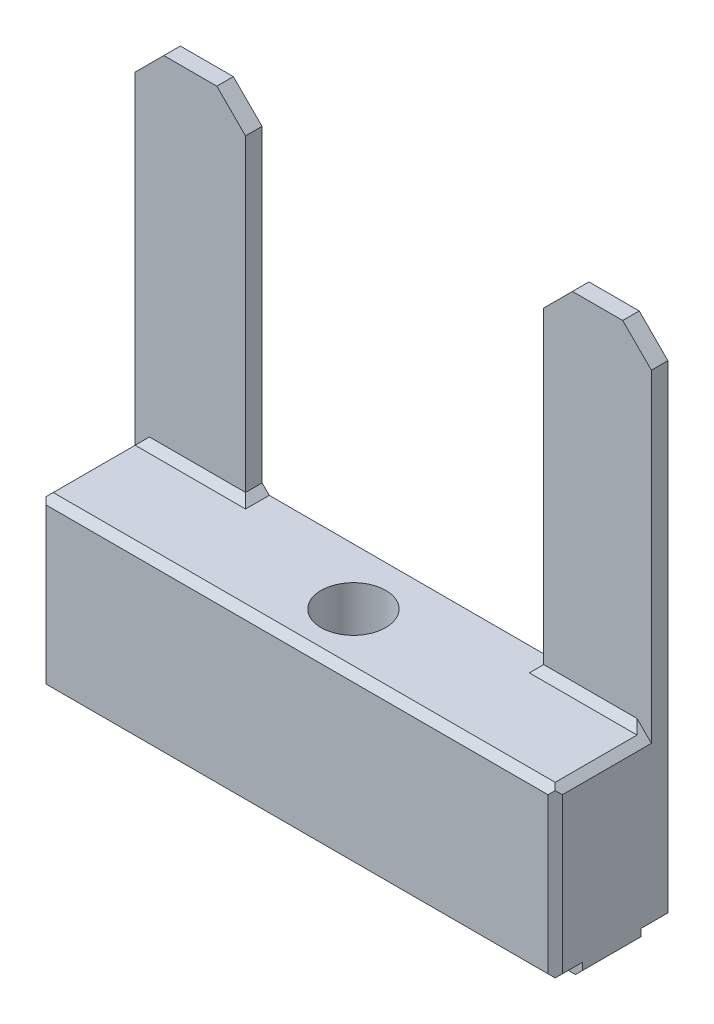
ISO-10303-21;
HEADER;
FILE_DESCRIPTION(('STEP AP214'),'2;1');
FILE_NAME('part.step','',(''),(''),'','','');
FILE_SCHEMA(('AUTOMOTIVE_DESIGN { 1 0 10303 214 1 1 1 1 }'));
ENDSEC;
DATA;
#1=APPLICATION_CONTEXT('core data for automotive mechanical design processes');
#2=APPLICATION_PROTOCOL_DEFINITION('international standard','automotive_design',2000,#1);
#3=PRODUCT_CONTEXT('',#1,'mechanical');
#4=PRODUCT('Part','Part','',(#3));
#5=PRODUCT_RELATED_PRODUCT_CATEGORY('part','',(#4));
#6=PRODUCT_DEFINITION_FORMATION('','',#4);
#7=PRODUCT_DEFINITION_CONTEXT('part definition',#1,'design');
#8=PRODUCT_DEFINITION('design','',#6,#7);
#9=PRODUCT_DEFINITION_SHAPE('','',#8);
#10=(LENGTH_UNIT() NAMED_UNIT(*) SI_UNIT(.MILLI.,.METRE.));
#11=(NAMED_UNIT(*) PLANE_ANGLE_UNIT() SI_UNIT($,.RADIAN.));
#12=(NAMED_UNIT(*) SI_UNIT($,.STERADIAN.) SOLID_ANGLE_UNIT());
#13=UNCERTAINTY_MEASURE_WITH_UNIT(LENGTH_MEASURE(1.E-05),#10,'distance_accuracy_value','');
#14=(GEOMETRIC_REPRESENTATION_CONTEXT(3) GLOBAL_UNCERTAINTY_ASSIGNED_CONTEXT((#13)) GLOBAL_UNIT_ASSIGNED_CONTEXT((#10,
#11,#12)) REPRESENTATION_CONTEXT('',''));
#15=CARTESIAN_POINT('',(0.,0.,0.));
#16=DIRECTION('',(0.,0.,1.));
#17=DIRECTION('',(1.,0.,0.));
#18=AXIS2_PLACEMENT_3D('',#15,#16,#17);
#19=CARTESIAN_POINT('',(0.,0.,2.921));
#20=DIRECTION('',(0.,0.,1.));
#21=DIRECTION('',(1.,0.,0.));
#22=AXIS2_PLACEMENT_3D('',#19,#20,#21);
#23=PLANE('',#22);
#24=DIRECTION('',(1.,0.,0.));
#25=VECTOR('',#24,1.);
#26=CARTESIAN_POINT('',(0.,90.932,2.921));
#27=LINE('',#26,#25);
#28=CARTESIAN_POINT('',(5.08000000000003,90.932,2.921));
#29=VERTEX_POINT('',#28);
#30=CARTESIAN_POINT('',(14.4526,90.932,2.921));
#31=VERTEX_POINT('',#30);
#32=EDGE_CURVE('E418',#29,#31,#27,.T.);
#33=ORIENTED_EDGE('',*,*,#32,.F.);
#34=DIRECTION('',(0.70710678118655,0.707106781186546,0.));
#35=VECTOR('',#34,1.);
#36=CARTESIAN_POINT('',(-42.926,42.9260000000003,2.921));
#37=LINE('',#36,#35);
#38=CARTESIAN_POINT('',(0.,85.852,2.921));
#39=VERTEX_POINT('',#38);
#40=EDGE_CURVE('E402',#29,#39,#37,.F.);
#41=ORIENTED_EDGE('',*,*,#40,.T.);
#42=DIRECTION('',(0.,1.,0.));
#43=VECTOR('',#42,1.);
#44=CARTESIAN_POINT('',(0.,0.,2.921));
#45=LINE('',#44,#43);
#46=CARTESIAN_POINT('',(0.,28.702,2.921));
#47=VERTEX_POINT('',#46);
#48=EDGE_CURVE('E422',#47,#39,#45,.T.);
#49=ORIENTED_EDGE('',*,*,#48,.F.);
#50=DIRECTION('',(-0.707106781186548,-0.707106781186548,0.));
#51=VECTOR('',#50,1.);
#52=CARTESIAN_POINT('',(0.,28.702,2.921));
#53=LINE('',#52,#51);
#54=CARTESIAN_POINT('',(2.54000000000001,31.242,2.921));
#55=VERTEX_POINT('',#54);
#56=EDGE_CURVE('E487',#47,#55,#53,.F.);
#57=ORIENTED_EDGE('',*,*,#56,.T.);
#58=DIRECTION('',(1.,0.,0.));
#59=VECTOR('',#58,1.);
#60=CARTESIAN_POINT('',(19.5326,31.242,2.921));
#61=LINE('',#60,#59);
#62=CARTESIAN_POINT('',(19.5326,31.242,2.921));
#63=VERTEX_POINT('',#62);
#64=EDGE_CURVE('E343',#55,#63,#61,.T.);
#65=ORIENTED_EDGE('',*,*,#64,.T.);
#66=DIRECTION('',(0.,1.,0.));
#67=VECTOR('',#66,1.);
#68=CARTESIAN_POINT('',(19.5326,29.972,2.921));
#69=LINE('',#68,#67);
#70=CARTESIAN_POINT('',(19.5326,85.852,2.921));
#71=VERTEX_POINT('',#70);
#72=EDGE_CURVE('E468',#63,#71,#69,.T.);
#73=ORIENTED_EDGE('',*,*,#72,.T.);
#74=DIRECTION('',(0.70710678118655,-0.707106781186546,0.));
#75=VECTOR('',#74,1.);
#76=CARTESIAN_POINT('',(52.6923,52.6923000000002,2.921));
#77=LINE('',#76,#75);
#78=EDGE_CURVE('E400',#71,#31,#77,.F.);
#79=ORIENTED_EDGE('',*,*,#78,.T.);
#80=EDGE_LOOP('',(#33,#41,#49,#57,#65,#73,#79));
#81=FACE_BOUND('',#80,.T.);
#82=ADVANCED_FACE('F35',(#81),#23,.T.);
#83=CARTESIAN_POINT('',(0.,90.932,2.921));
#84=DIRECTION('',(0.,1.,0.));
#85=DIRECTION('',(0.,0.,1.));
#86=AXIS2_PLACEMENT_3D('',#83,#84,#85);
#87=PLANE('',#86);
#88=DIRECTION('',(1.,0.,0.));
#89=VECTOR('',#88,1.);
#90=CARTESIAN_POINT('',(0.,90.932,0.));
#91=LINE('',#90,#89);
#92=CARTESIAN_POINT('',(5.08000000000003,90.932,0.));
#93=VERTEX_POINT('',#92);
#94=CARTESIAN_POINT('',(14.4526,90.932,0.));
#95=VERTEX_POINT('',#94);
#96=EDGE_CURVE('E432',#93,#95,#91,.T.);
#97=ORIENTED_EDGE('',*,*,#96,.F.);
#98=DIRECTION('',(0.,0.,1.));
#99=VECTOR('',#98,1.);
#100=CARTESIAN_POINT('',(5.08000000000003,90.932,2.921));
#101=LINE('',#100,#99);
#102=EDGE_CURVE('E398',#93,#29,#101,.T.);
#103=ORIENTED_EDGE('',*,*,#102,.T.);
#104=ORIENTED_EDGE('',*,*,#32,.T.);
#105=DIRECTION('',(0.,0.,-1.));
#106=VECTOR('',#105,1.);
#107=CARTESIAN_POINT('',(14.4526,90.932,2.921));
#108=LINE('',#107,#106);
#109=EDGE_CURVE('E396',#31,#95,#108,.T.);
#110=ORIENTED_EDGE('',*,*,#109,.T.);
#111=EDGE_LOOP('',(#97,#103,#104,#110));
#112=FACE_BOUND('',#111,.T.);
#113=ADVANCED_FACE('F604',(#112),#87,.T.);
#114=CARTESIAN_POINT('',(0.,0.,0.));
#115=DIRECTION('',(0.,0.,1.));
#116=DIRECTION('',(1.,0.,0.));
#117=AXIS2_PLACEMENT_3D('',#114,#115,#116);
#118=PLANE('',#117);
#119=DIRECTION('',(0.,1.,0.));
#120=VECTOR('',#119,1.);
#121=CARTESIAN_POINT('',(0.,0.,0.));
#122=LINE('',#121,#120);
#123=CARTESIAN_POINT('',(0.,1.26999999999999,0.));
#124=VERTEX_POINT('',#123);
#125=CARTESIAN_POINT('',(0.,85.852,0.));
#126=VERTEX_POINT('',#125);
#127=EDGE_CURVE('E423',#124,#126,#122,.T.);
#128=ORIENTED_EDGE('',*,*,#127,.T.);
#129=DIRECTION('',(-0.70710678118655,-0.707106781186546,0.));
#130=VECTOR('',#129,1.);
#131=CARTESIAN_POINT('',(0.,85.852,0.));
#132=LINE('',#131,#130);
#133=EDGE_CURVE('E394',#126,#93,#132,.F.);
#134=ORIENTED_EDGE('',*,*,#133,.T.);
#135=ORIENTED_EDGE('',*,*,#96,.T.);
#136=DIRECTION('',(-0.70710678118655,0.707106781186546,0.));
#137=VECTOR('',#136,1.);
#138=CARTESIAN_POINT('',(19.5326,85.852,0.));
#139=LINE('',#138,#137);
#140=CARTESIAN_POINT('',(19.5326,85.852,0.));
#141=VERTEX_POINT('',#140);
#142=EDGE_CURVE('E392',#95,#141,#139,.F.);
#143=ORIENTED_EDGE('',*,*,#142,.T.);
#144=DIRECTION('',(0.,1.,0.));
#145=VECTOR('',#144,1.);
#146=CARTESIAN_POINT('',(19.5326,29.972,0.));
#147=LINE('',#146,#145);
#148=CARTESIAN_POINT('',(19.5326,31.242,0.));
#149=VERTEX_POINT('',#148);
#150=EDGE_CURVE('E524',#149,#141,#147,.T.);
#151=ORIENTED_EDGE('',*,*,#150,.F.);
#152=DIRECTION('',(-0.707106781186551,0.707106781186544,0.));
#153=VECTOR('',#152,1.);
#154=CARTESIAN_POINT('',(25.3872999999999,25.3873000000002,0.));
#155=LINE('',#154,#153);
#156=CARTESIAN_POINT('',(20.8026,29.972,0.));
#157=VERTEX_POINT('',#156);
#158=EDGE_CURVE('E370',#149,#157,#155,.F.);
#159=ORIENTED_EDGE('',*,*,#158,.T.);
#160=DIRECTION('',(-1.,0.,0.));
#161=VECTOR('',#160,1.);
#162=CARTESIAN_POINT('',(72.263,29.972,0.));
#163=LINE('',#162,#161);
#164=CARTESIAN_POINT('',(70.993,29.972,0.));
#165=VERTEX_POINT('',#164);
#166=EDGE_CURVE('E531',#165,#157,#163,.T.);
#167=ORIENTED_EDGE('',*,*,#166,.F.);
#168=DIRECTION('',(0.707106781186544,0.707106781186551,0.));
#169=VECTOR('',#168,1.);
#170=CARTESIAN_POINT('',(20.5105000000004,-20.5105000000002,0.));
#171=LINE('',#170,#169);
#172=CARTESIAN_POINT('',(72.263,31.242,0.));
#173=VERTEX_POINT('',#172);
#174=EDGE_CURVE('E375',#165,#173,#171,.T.);
#175=ORIENTED_EDGE('',*,*,#174,.T.);
#176=DIRECTION('',(0.,1.,0.));
#177=VECTOR('',#176,1.);
#178=CARTESIAN_POINT('',(72.263,29.972,0.));
#179=LINE('',#178,#177);
#180=CARTESIAN_POINT('',(72.263,85.852,0.));
#181=VERTEX_POINT('',#180);
#182=EDGE_CURVE('E520',#173,#181,#179,.T.);
#183=ORIENTED_EDGE('',*,*,#182,.T.);
#184=DIRECTION('',(0.707106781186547,0.707106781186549,0.));
#185=VECTOR('',#184,1.);
#186=CARTESIAN_POINT('',(77.343,90.932,0.));
#187=LINE('',#186,#185);
#188=CARTESIAN_POINT('',(77.343,90.932,0.));
#189=VERTEX_POINT('',#188);
#190=EDGE_CURVE('E390',#181,#189,#187,.T.);
#191=ORIENTED_EDGE('',*,*,#190,.T.);
#192=CARTESIAN_POINT('',(86.233,90.932,0.));
#193=VERTEX_POINT('',#192);
#194=EDGE_CURVE('E412',#189,#193,#91,.T.);
#195=ORIENTED_EDGE('',*,*,#194,.T.);
#196=DIRECTION('',(0.707106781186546,-0.70710678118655,0.));
#197=VECTOR('',#196,1.);
#198=CARTESIAN_POINT('',(86.233,90.932,0.));
#199=LINE('',#198,#197);
#200=CARTESIAN_POINT('',(91.313,85.852,0.));
#201=VERTEX_POINT('',#200);
#202=EDGE_CURVE('E380',#193,#201,#199,.T.);
#203=ORIENTED_EDGE('',*,*,#202,.T.);
#204=DIRECTION('',(0.,1.,0.));
#205=VECTOR('',#204,1.);
#206=CARTESIAN_POINT('',(91.313,0.,0.));
#207=LINE('',#206,#205);
#208=CARTESIAN_POINT('',(91.313,1.26999999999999,0.));
#209=VERTEX_POINT('',#208);
#210=EDGE_CURVE('E430',#209,#201,#207,.T.);
#211=ORIENTED_EDGE('',*,*,#210,.F.);
#212=DIRECTION('',(-1.,0.,0.));
#213=VECTOR('',#212,1.);
#214=CARTESIAN_POINT('',(0.,1.26999999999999,0.));
#215=LINE('',#214,#213);
#216=EDGE_CURVE('E275',#209,#124,#215,.T.);
#217=ORIENTED_EDGE('',*,*,#216,.T.);
#218=EDGE_LOOP('',(#128,#134,#135,#143,#151,#159,#167,#175,#183,#191,#195,#203,#211,#217));
#219=FACE_BOUND('',#218,.T.);
#220=ADVANCED_FACE('F499',(#219),#118,.F.);
#221=CARTESIAN_POINT('',(0.,0.,2.921));
#222=DIRECTION('',(0.,1.,0.));
#223=DIRECTION('',(0.,0.,1.));
#224=AXIS2_PLACEMENT_3D('',#221,#222,#223);
#225=PLANE('',#224);
#226=DIRECTION('',(1.,0.,0.));
#227=VECTOR('',#226,1.);
#228=CARTESIAN_POINT('',(0.,0.,4.7752));
#229=LINE('',#228,#227);
#230=CARTESIAN_POINT('',(1.26999999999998,0.,4.7752));
#231=VERTEX_POINT('',#230);
#232=CARTESIAN_POINT('',(90.043,0.,4.7752));
#233=VERTEX_POINT('',#232);
#234=EDGE_CURVE('E513',#231,#233,#229,.T.);
#235=ORIENTED_EDGE('',*,*,#234,.F.);
#236=DIRECTION('',(0.,0.,-1.));
#237=VECTOR('',#236,1.);
#238=CARTESIAN_POINT('',(1.26999999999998,0.,1.26999999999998));
#239=LINE('',#238,#237);
#240=CARTESIAN_POINT('',(1.26999999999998,0.,1.26999999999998));
#241=VERTEX_POINT('',#240);
#242=EDGE_CURVE('E306',#231,#241,#239,.T.);
#243=ORIENTED_EDGE('',*,*,#242,.T.);
#244=DIRECTION('',(1.,0.,0.));
#245=VECTOR('',#244,1.);
#246=CARTESIAN_POINT('',(0.,0.,1.26999999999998));
#247=LINE('',#246,#245);
#248=CARTESIAN_POINT('',(90.043,0.,1.26999999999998));
#249=VERTEX_POINT('',#248);
#250=EDGE_CURVE('E492',#241,#249,#247,.T.);
#251=ORIENTED_EDGE('',*,*,#250,.T.);
#252=DIRECTION('',(0.,0.,1.));
#253=VECTOR('',#252,1.);
#254=CARTESIAN_POINT('',(90.043,0.,2.921));
#255=LINE('',#254,#253);
#256=EDGE_CURVE('E292',#249,#233,#255,.T.);
#257=ORIENTED_EDGE('',*,*,#256,.T.);
#258=EDGE_LOOP('',(#235,#243,#251,#257));
#259=FACE_BOUND('',#258,.T.);
#260=ADVANCED_FACE('F515',(#259),#225,.F.);
#261=CARTESIAN_POINT('',(77.343,90.932,2.921));
#262=VERTEX_POINT('',#261);
#263=CARTESIAN_POINT('',(86.233,90.932,2.921));
#264=VERTEX_POINT('',#263);
#265=EDGE_CURVE('E411',#262,#264,#27,.T.);
#266=ORIENTED_EDGE('',*,*,#265,.F.);
#267=DIRECTION('',(-0.707106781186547,-0.707106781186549,0.));
#268=VECTOR('',#267,1.);
#269=CARTESIAN_POINT('',(-6.79449999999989,6.79449999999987,2.921));
#270=LINE('',#269,#268);
#271=CARTESIAN_POINT('',(72.263,85.852,2.921));
#272=VERTEX_POINT('',#271);
#273=EDGE_CURVE('E44',#262,#272,#270,.T.);
#274=ORIENTED_EDGE('',*,*,#273,.T.);
#275=DIRECTION('',(0.,1.,0.));
#276=VECTOR('',#275,1.);
#277=CARTESIAN_POINT('',(72.263,29.972,2.921));
#278=LINE('',#277,#276);
#279=CARTESIAN_POINT('',(72.263,31.242,2.921));
#280=VERTEX_POINT('',#279);
#281=EDGE_CURVE('E529',#280,#272,#278,.T.);
#282=ORIENTED_EDGE('',*,*,#281,.F.);
#283=DIRECTION('',(1.,0.,0.));
#284=VECTOR('',#283,1.);
#285=CARTESIAN_POINT('',(90.043,31.242,2.921));
#286=LINE('',#285,#284);
#287=CARTESIAN_POINT('',(88.773,31.242,2.921));
#288=VERTEX_POINT('',#287);
#289=EDGE_CURVE('E350',#280,#288,#286,.T.);
#290=ORIENTED_EDGE('',*,*,#289,.T.);
#291=DIRECTION('',(0.707106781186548,-0.707106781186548,0.));
#292=VECTOR('',#291,1.);
#293=CARTESIAN_POINT('',(90.043,29.972,2.921));
#294=LINE('',#293,#292);
#295=CARTESIAN_POINT('',(91.313,28.702,2.921));
#296=VERTEX_POINT('',#295);
#297=EDGE_CURVE('E489',#288,#296,#294,.T.);
#298=ORIENTED_EDGE('',*,*,#297,.T.);
#299=DIRECTION('',(0.,1.,0.));
#300=VECTOR('',#299,1.);
#301=CARTESIAN_POINT('',(91.313,0.,2.921));
#302=LINE('',#301,#300);
#303=CARTESIAN_POINT('',(91.313,85.852,2.921));
#304=VERTEX_POINT('',#303);
#305=EDGE_CURVE('E419',#296,#304,#302,.T.);
#306=ORIENTED_EDGE('',*,*,#305,.T.);
#307=DIRECTION('',(-0.707106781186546,0.70710678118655,0.));
#308=VECTOR('',#307,1.);
#309=CARTESIAN_POINT('',(88.5825000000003,88.5824999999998,2.921));
#310=LINE('',#309,#308);
#311=EDGE_CURVE('E384',#304,#264,#310,.T.);
#312=ORIENTED_EDGE('',*,*,#311,.T.);
#313=EDGE_LOOP('',(#266,#274,#282,#290,#298,#306,#312));
#314=FACE_BOUND('',#313,.T.);
#315=ADVANCED_FACE('F414',(#314),#23,.T.);
#316=DIRECTION('',(-1.,0.,0.));
#317=VECTOR('',#316,1.);
#318=CARTESIAN_POINT('',(0.,0.,18.669));
#319=LINE('',#318,#317);
#320=CARTESIAN_POINT('',(90.043,0.,18.669));
#321=VERTEX_POINT('',#320);
#322=CARTESIAN_POINT('',(1.26999999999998,0.,18.669));
#323=VERTEX_POINT('',#322);
#324=EDGE_CURVE('E457',#321,#323,#319,.T.);
#325=ORIENTED_EDGE('',*,*,#324,.T.);
#326=DIRECTION('',(0.,0.,-1.));
#327=VECTOR('',#326,1.);
#328=CARTESIAN_POINT('',(1.26999999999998,0.,15.0876));
#329=LINE('',#328,#327);
#330=CARTESIAN_POINT('',(1.26999999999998,0.,15.0876));
#331=VERTEX_POINT('',#330);
#332=EDGE_CURVE('E332',#323,#331,#329,.T.);
#333=ORIENTED_EDGE('',*,*,#332,.T.);
#334=DIRECTION('',(1.,0.,0.));
#335=VECTOR('',#334,1.);
#336=CARTESIAN_POINT('',(0.,0.,15.0876));
#337=LINE('',#336,#335);
#338=CARTESIAN_POINT('',(90.043,0.,15.0876));
#339=VERTEX_POINT('',#338);
#340=EDGE_CURVE('E519',#331,#339,#337,.T.);
#341=ORIENTED_EDGE('',*,*,#340,.T.);
#342=DIRECTION('',(0.,0.,1.));
#343=VECTOR('',#342,1.);
#344=CARTESIAN_POINT('',(90.043,0.,2.921));
#345=LINE('',#344,#343);
#346=EDGE_CURVE('E263',#339,#321,#345,.T.);
#347=ORIENTED_EDGE('',*,*,#346,.T.);
#348=EDGE_LOOP('',(#325,#333,#341,#347));
#349=FACE_BOUND('',#348,.T.);
#350=ADVANCED_FACE('F653',(#349),#225,.F.);
#351=CARTESIAN_POINT('',(91.313,0.,2.921));
#352=DIRECTION('',(-1.,0.,0.));
#353=DIRECTION('',(0.,0.,1.));
#354=AXIS2_PLACEMENT_3D('',#351,#352,#353);
#355=PLANE('',#354);
#356=ORIENTED_EDGE('',*,*,#210,.T.);
#357=DIRECTION('',(0.,0.,1.));
#358=VECTOR('',#357,1.);
#359=CARTESIAN_POINT('',(91.313,85.852,2.921));
#360=LINE('',#359,#358);
#361=EDGE_CURVE('E382',#201,#304,#360,.T.);
#362=ORIENTED_EDGE('',*,*,#361,.T.);
#363=ORIENTED_EDGE('',*,*,#305,.F.);
#364=DIRECTION('',(0.,0.,1.));
#365=VECTOR('',#364,1.);
#366=CARTESIAN_POINT('',(91.313,28.702,18.669));
#367=LINE('',#366,#365);
#368=CARTESIAN_POINT('',(91.313,28.702,18.669));
#369=VERTEX_POINT('',#368);
#370=EDGE_CURVE('E483',#296,#369,#367,.T.);
#371=ORIENTED_EDGE('',*,*,#370,.T.);
#372=DIRECTION('',(0.,-1.,0.));
#373=VECTOR('',#372,1.);
#374=CARTESIAN_POINT('',(91.313,0.,18.669));
#375=LINE('',#374,#373);
#376=CARTESIAN_POINT('',(91.313,1.26999999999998,18.669));
#377=VERTEX_POINT('',#376);
#378=EDGE_CURVE('E460',#369,#377,#375,.T.);
#379=ORIENTED_EDGE('',*,*,#378,.T.);
#380=DIRECTION('',(0.,0.,-1.));
#381=VECTOR('',#380,1.);
#382=CARTESIAN_POINT('',(91.313,1.26999999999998,2.921));
#383=LINE('',#382,#381);
#384=CARTESIAN_POINT('',(91.313,1.26999999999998,15.0876));
#385=VERTEX_POINT('',#384);
#386=EDGE_CURVE('E274',#377,#385,#383,.T.);
#387=ORIENTED_EDGE('',*,*,#386,.T.);
#388=DIRECTION('',(0.,1.,0.));
#389=VECTOR('',#388,1.);
#390=CARTESIAN_POINT('',(91.313,-1.27,15.0876));
#391=LINE('',#390,#389);
#392=CARTESIAN_POINT('',(91.313,0.,15.0876));
#393=VERTEX_POINT('',#392);
#394=EDGE_CURVE('E255',#385,#393,#391,.F.);
#395=ORIENTED_EDGE('',*,*,#394,.T.);
#396=DIRECTION('',(0.,0.,-1.));
#397=VECTOR('',#396,1.);
#398=CARTESIAN_POINT('',(91.313,0.,4.7752));
#399=LINE('',#398,#397);
#400=CARTESIAN_POINT('',(91.313,0.,4.7752));
#401=VERTEX_POINT('',#400);
#402=EDGE_CURVE('E271',#393,#401,#399,.T.);
#403=ORIENTED_EDGE('',*,*,#402,.T.);
#404=DIRECTION('',(0.,1.,0.));
#405=VECTOR('',#404,1.);
#406=CARTESIAN_POINT('',(91.313,-1.27,4.7752));
#407=LINE('',#406,#405);
#408=CARTESIAN_POINT('',(91.313,1.26999999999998,4.7752));
#409=VERTEX_POINT('',#408);
#410=EDGE_CURVE('E281',#401,#409,#407,.T.);
#411=ORIENTED_EDGE('',*,*,#410,.T.);
#412=DIRECTION('',(0.,0.,-1.));
#413=VECTOR('',#412,1.);
#414=CARTESIAN_POINT('',(91.313,1.26999999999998,2.921));
#415=LINE('',#414,#413);
#416=EDGE_CURVE('E283',#409,#209,#415,.T.);
#417=ORIENTED_EDGE('',*,*,#416,.T.);
#418=EDGE_LOOP('',(#356,#362,#363,#371,#379,#387,#395,#403,#411,#417));
#419=FACE_BOUND('',#418,.T.);
#420=ADVANCED_FACE('F269',(#419),#355,.F.);
#421=ORIENTED_EDGE('',*,*,#194,.F.);
#422=DIRECTION('',(0.,0.,1.));
#423=VECTOR('',#422,1.);
#424=CARTESIAN_POINT('',(77.343,90.932,2.921));
#425=LINE('',#424,#423);
#426=EDGE_CURVE('E407',#189,#262,#425,.T.);
#427=ORIENTED_EDGE('',*,*,#426,.T.);
#428=ORIENTED_EDGE('',*,*,#265,.T.);
#429=DIRECTION('',(0.,0.,-1.));
#430=VECTOR('',#429,1.);
#431=CARTESIAN_POINT('',(86.233,90.932,0.));
#432=LINE('',#431,#430);
#433=EDGE_CURVE('E377',#264,#193,#432,.T.);
#434=ORIENTED_EDGE('',*,*,#433,.T.);
#435=EDGE_LOOP('',(#421,#427,#428,#434));
#436=FACE_BOUND('',#435,.T.);
#437=ADVANCED_FACE('F410',(#436),#87,.T.);
#438=CARTESIAN_POINT('',(0.,0.,2.921));
#439=DIRECTION('',(-1.,0.,0.));
#440=DIRECTION('',(0.,0.,1.));
#441=AXIS2_PLACEMENT_3D('',#438,#439,#440);
#442=PLANE('',#441);
#443=ORIENTED_EDGE('',*,*,#48,.T.);
#444=DIRECTION('',(0.,0.,-1.));
#445=VECTOR('',#444,1.);
#446=CARTESIAN_POINT('',(0.,85.852,2.921));
#447=LINE('',#446,#445);
#448=EDGE_CURVE('E387',#39,#126,#447,.T.);
#449=ORIENTED_EDGE('',*,*,#448,.T.);
#450=ORIENTED_EDGE('',*,*,#127,.F.);
#451=DIRECTION('',(0.,0.,1.));
#452=VECTOR('',#451,1.);
#453=CARTESIAN_POINT('',(0.,1.26999999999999,4.7752));
#454=LINE('',#453,#452);
#455=CARTESIAN_POINT('',(0.,1.26999999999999,4.7752));
#456=VERTEX_POINT('',#455);
#457=EDGE_CURVE('E322',#124,#456,#454,.T.);
#458=ORIENTED_EDGE('',*,*,#457,.T.);
#459=DIRECTION('',(0.,1.,0.));
#460=VECTOR('',#459,1.);
#461=CARTESIAN_POINT('',(0.,-1.27,4.7752));
#462=LINE('',#461,#460);
#463=CARTESIAN_POINT('',(0.,0.,4.7752));
#464=VERTEX_POINT('',#463);
#465=EDGE_CURVE('E319',#456,#464,#462,.F.);
#466=ORIENTED_EDGE('',*,*,#465,.T.);
#467=DIRECTION('',(0.,0.,1.));
#468=VECTOR('',#467,1.);
#469=CARTESIAN_POINT('',(0.,0.,2.921));
#470=LINE('',#469,#468);
#471=CARTESIAN_POINT('',(0.,0.,15.0876));
#472=VERTEX_POINT('',#471);
#473=EDGE_CURVE('E316',#464,#472,#470,.T.);
#474=ORIENTED_EDGE('',*,*,#473,.T.);
#475=DIRECTION('',(0.,1.,0.));
#476=VECTOR('',#475,1.);
#477=CARTESIAN_POINT('',(0.,-1.27,15.0876));
#478=LINE('',#477,#476);
#479=CARTESIAN_POINT('',(0.,1.26999999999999,15.0876));
#480=VERTEX_POINT('',#479);
#481=EDGE_CURVE('E313',#472,#480,#478,.T.);
#482=ORIENTED_EDGE('',*,*,#481,.T.);
#483=DIRECTION('',(0.,0.,1.));
#484=VECTOR('',#483,1.);
#485=CARTESIAN_POINT('',(0.,1.26999999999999,18.669));
#486=LINE('',#485,#484);
#487=CARTESIAN_POINT('',(0.,1.26999999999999,18.669));
#488=VERTEX_POINT('',#487);
#489=EDGE_CURVE('E311',#480,#488,#486,.T.);
#490=ORIENTED_EDGE('',*,*,#489,.T.);
#491=DIRECTION('',(0.,1.,0.));
#492=VECTOR('',#491,1.);
#493=CARTESIAN_POINT('',(0.,28.702,18.669));
#494=LINE('',#493,#492);
#495=CARTESIAN_POINT('',(0.,28.702,18.669));
#496=VERTEX_POINT('',#495);
#497=EDGE_CURVE('E442',#488,#496,#494,.T.);
#498=ORIENTED_EDGE('',*,*,#497,.T.);
#499=DIRECTION('',(0.,0.,-1.));
#500=VECTOR('',#499,1.);
#501=CARTESIAN_POINT('',(0.,28.702,2.921));
#502=LINE('',#501,#500);
#503=EDGE_CURVE('E462',#496,#47,#502,.T.);
#504=ORIENTED_EDGE('',*,*,#503,.T.);
#505=EDGE_LOOP('',(#443,#449,#450,#458,#466,#474,#482,#490,#498,#504));
#506=FACE_BOUND('',#505,.T.);
#507=ADVANCED_FACE('F503',(#506),#442,.T.);
#508=CARTESIAN_POINT('',(0.,29.972,19.939));
#509=DIRECTION('',(0.,1.,0.));
#510=DIRECTION('',(0.,0.,1.));
#511=AXIS2_PLACEMENT_3D('',#508,#509,#510);
#512=PLANE('',#511);
#513=CARTESIAN_POINT('',(45.6565,29.972,9.9695));
#514=DIRECTION('',(0.,1.,0.));
#515=DIRECTION('',(0.,0.,1.));
#516=AXIS2_PLACEMENT_3D('',#513,#514,#515);
#517=CIRCLE('',#516,5.715);
#518=CARTESIAN_POINT('',(45.6565,29.972,15.6845));
#519=VERTEX_POINT('',#518);
#520=EDGE_CURVE('E538',#519,#519,#517,.T.);
#521=ORIENTED_EDGE('',*,*,#520,.F.);
#522=EDGE_LOOP('',(#521));
#523=FACE_BOUND('',#522,.T.);
#524=ORIENTED_EDGE('',*,*,#166,.T.);
#525=DIRECTION('',(0.,0.,1.));
#526=VECTOR('',#525,1.);
#527=CARTESIAN_POINT('',(20.8026,29.972,4.19099999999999));
#528=LINE('',#527,#526);
#529=CARTESIAN_POINT('',(20.8026,29.972,4.19099999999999));
#530=VERTEX_POINT('',#529);
#531=EDGE_CURVE('E360',#157,#530,#528,.T.);
#532=ORIENTED_EDGE('',*,*,#531,.T.);
#533=DIRECTION('',(-1.,0.,0.));
#534=VECTOR('',#533,1.);
#535=CARTESIAN_POINT('',(1.27000000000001,29.972,4.19099999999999));
#536=LINE('',#535,#534);
#537=CARTESIAN_POINT('',(1.27000000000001,29.972,4.19099999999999));
#538=VERTEX_POINT('',#537);
#539=EDGE_CURVE('E348',#530,#538,#536,.T.);
#540=ORIENTED_EDGE('',*,*,#539,.T.);
#541=DIRECTION('',(0.,0.,1.));
#542=VECTOR('',#541,1.);
#543=CARTESIAN_POINT('',(1.27000000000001,29.972,19.939));
#544=LINE('',#543,#542);
#545=CARTESIAN_POINT('',(1.27000000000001,29.972,18.669));
#546=VERTEX_POINT('',#545);
#547=EDGE_CURVE('E474',#538,#546,#544,.T.);
#548=ORIENTED_EDGE('',*,*,#547,.T.);
#549=DIRECTION('',(1.,0.,0.));
#550=VECTOR('',#549,1.);
#551=CARTESIAN_POINT('',(91.313,29.972,18.669));
#552=LINE('',#551,#550);
#553=CARTESIAN_POINT('',(90.043,29.972,18.669));
#554=VERTEX_POINT('',#553);
#555=EDGE_CURVE('E429',#546,#554,#552,.T.);
#556=ORIENTED_EDGE('',*,*,#555,.T.);
#557=DIRECTION('',(0.,0.,-1.));
#558=VECTOR('',#557,1.);
#559=CARTESIAN_POINT('',(90.043,29.972,2.921));
#560=LINE('',#559,#558);
#561=CARTESIAN_POINT('',(90.043,29.972,4.19099999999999));
#562=VERTEX_POINT('',#561);
#563=EDGE_CURVE('E471',#554,#562,#560,.T.);
#564=ORIENTED_EDGE('',*,*,#563,.T.);
#565=DIRECTION('',(-1.,0.,0.));
#566=VECTOR('',#565,1.);
#567=CARTESIAN_POINT('',(72.263,29.972,4.19099999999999));
#568=LINE('',#567,#566);
#569=CARTESIAN_POINT('',(70.993,29.972,4.19099999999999));
#570=VERTEX_POINT('',#569);
#571=EDGE_CURVE('E346',#562,#570,#568,.T.);
#572=ORIENTED_EDGE('',*,*,#571,.T.);
#573=DIRECTION('',(0.,0.,-1.));
#574=VECTOR('',#573,1.);
#575=CARTESIAN_POINT('',(70.993,29.972,19.939));
#576=LINE('',#575,#574);
#577=EDGE_CURVE('E358',#570,#165,#576,.T.);
#578=ORIENTED_EDGE('',*,*,#577,.T.);
#579=EDGE_LOOP('',(#524,#532,#540,#548,#556,#564,#572,#578));
#580=FACE_BOUND('',#579,.T.);
#581=ADVANCED_FACE('F571',(#523,#580),#512,.T.);
#582=CARTESIAN_POINT('',(0.,0.,19.939));
#583=DIRECTION('',(0.,0.,-1.));
#584=DIRECTION('',(-1.,0.,0.));
#585=AXIS2_PLACEMENT_3D('',#582,#583,#584);
#586=PLANE('',#585);
#587=DIRECTION('',(-1.,0.,0.));
#588=VECTOR('',#587,1.);
#589=CARTESIAN_POINT('',(0.,28.702,19.939));
#590=LINE('',#589,#588);
#591=CARTESIAN_POINT('',(90.043,28.702,19.939));
#592=VERTEX_POINT('',#591);
#593=CARTESIAN_POINT('',(1.27000000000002,28.702,19.939));
#594=VERTEX_POINT('',#593);
#595=EDGE_CURVE('E439',#592,#594,#590,.T.);
#596=ORIENTED_EDGE('',*,*,#595,.T.);
#597=DIRECTION('',(0.,-1.,0.));
#598=VECTOR('',#597,1.);
#599=CARTESIAN_POINT('',(1.27000000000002,0.,19.939));
#600=LINE('',#599,#598);
#601=CARTESIAN_POINT('',(1.27000000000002,1.27000000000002,19.939));
#602=VERTEX_POINT('',#601);
#603=EDGE_CURVE('E454',#594,#602,#600,.T.);
#604=ORIENTED_EDGE('',*,*,#603,.T.);
#605=DIRECTION('',(1.,0.,0.));
#606=VECTOR('',#605,1.);
#607=CARTESIAN_POINT('',(0.,1.27000000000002,19.939));
#608=LINE('',#607,#606);
#609=CARTESIAN_POINT('',(90.043,1.27000000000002,19.939));
#610=VERTEX_POINT('',#609);
#611=EDGE_CURVE('E451',#602,#610,#608,.T.);
#612=ORIENTED_EDGE('',*,*,#611,.T.);
#613=DIRECTION('',(0.,1.,0.));
#614=VECTOR('',#613,1.);
#615=CARTESIAN_POINT('',(90.043,0.,19.939));
#616=LINE('',#615,#614);
#617=EDGE_CURVE('E449',#610,#592,#616,.T.);
#618=ORIENTED_EDGE('',*,*,#617,.T.);
#619=EDGE_LOOP('',(#596,#604,#612,#618));
#620=FACE_BOUND('',#619,.T.);
#621=ADVANCED_FACE('F574',(#620),#586,.F.);
#622=CARTESIAN_POINT('',(0.,-1.27,4.7752));
#623=DIRECTION('',(0.,0.,1.));
#624=DIRECTION('',(1.,0.,0.));
#625=AXIS2_PLACEMENT_3D('',#622,#623,#624);
#626=PLANE('',#625);
#627=DIRECTION('',(1.,0.,0.));
#628=VECTOR('',#627,1.);
#629=CARTESIAN_POINT('',(0.,-1.27,4.7752));
#630=LINE('',#629,#628);
#631=CARTESIAN_POINT('',(1.26999999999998,-1.27,4.7752));
#632=VERTEX_POINT('',#631);
#633=CARTESIAN_POINT('',(90.043,-1.27,4.7752));
#634=VERTEX_POINT('',#633);
#635=EDGE_CURVE('E522',#632,#634,#630,.T.);
#636=ORIENTED_EDGE('',*,*,#635,.F.);
#637=DIRECTION('',(0.707106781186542,-0.707106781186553,0.));
#638=VECTOR('',#637,1.);
#639=CARTESIAN_POINT('',(1.26999999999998,-1.27,4.7752));
#640=LINE('',#639,#638);
#641=EDGE_CURVE('E328',#632,#464,#640,.F.);
#642=ORIENTED_EDGE('',*,*,#641,.T.);
#643=ORIENTED_EDGE('',*,*,#465,.F.);
#644=DIRECTION('',(0.707106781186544,-0.707106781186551,0.));
#645=VECTOR('',#644,1.);
#646=CARTESIAN_POINT('',(1.27,0.,4.7752));
#647=LINE('',#646,#645);
#648=EDGE_CURVE('E339',#456,#231,#647,.T.);
#649=ORIENTED_EDGE('',*,*,#648,.T.);
#650=ORIENTED_EDGE('',*,*,#234,.T.);
#651=DIRECTION('',(-0.707106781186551,-0.707106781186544,0.));
#652=VECTOR('',#651,1.);
#653=CARTESIAN_POINT('',(44.3864999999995,-45.6565,4.7752));
#654=LINE('',#653,#652);
#655=EDGE_CURVE('E302',#233,#409,#654,.F.);
#656=ORIENTED_EDGE('',*,*,#655,.T.);
#657=ORIENTED_EDGE('',*,*,#410,.F.);
#658=DIRECTION('',(-0.707106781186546,-0.707106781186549,0.));
#659=VECTOR('',#658,1.);
#660=CARTESIAN_POINT('',(91.313,0.,4.7752));
#661=LINE('',#660,#659);
#662=EDGE_CURVE('E279',#401,#634,#661,.T.);
#663=ORIENTED_EDGE('',*,*,#662,.T.);
#664=EDGE_LOOP('',(#636,#642,#643,#649,#650,#656,#657,#663));
#665=FACE_BOUND('',#664,.T.);
#666=ADVANCED_FACE('F512',(#665),#626,.F.);
#667=CARTESIAN_POINT('',(0.,-1.27,15.0876));
#668=DIRECTION('',(0.,0.,1.));
#669=DIRECTION('',(1.,0.,0.));
#670=AXIS2_PLACEMENT_3D('',#667,#668,#669);
#671=PLANE('',#670);
#672=ORIENTED_EDGE('',*,*,#340,.F.);
#673=DIRECTION('',(-0.707106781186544,0.707106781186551,0.));
#674=VECTOR('',#673,1.);
#675=CARTESIAN_POINT('',(1.26999999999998,0.,15.0876));
#676=LINE('',#675,#674);
#677=EDGE_CURVE('E341',#331,#480,#676,.T.);
#678=ORIENTED_EDGE('',*,*,#677,.T.);
#679=ORIENTED_EDGE('',*,*,#481,.F.);
#680=DIRECTION('',(-0.707106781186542,0.707106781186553,0.));
#681=VECTOR('',#680,1.);
#682=CARTESIAN_POINT('',(0.635,-0.63500000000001,15.0876));
#683=LINE('',#682,#681);
#684=CARTESIAN_POINT('',(1.26999999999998,-1.27,15.0876));
#685=VERTEX_POINT('',#684);
#686=EDGE_CURVE('E330',#472,#685,#683,.F.);
#687=ORIENTED_EDGE('',*,*,#686,.T.);
#688=DIRECTION('',(1.,0.,0.));
#689=VECTOR('',#688,1.);
#690=CARTESIAN_POINT('',(0.,-1.27,15.0876));
#691=LINE('',#690,#689);
#692=CARTESIAN_POINT('',(90.043,-1.27,15.0876));
#693=VERTEX_POINT('',#692);
#694=EDGE_CURVE('E258',#685,#693,#691,.T.);
#695=ORIENTED_EDGE('',*,*,#694,.T.);
#696=DIRECTION('',(0.707106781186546,0.707106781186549,0.));
#697=VECTOR('',#696,1.);
#698=CARTESIAN_POINT('',(45.0215000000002,-46.2915,15.0876));
#699=LINE('',#698,#697);
#700=EDGE_CURVE('E250',#693,#393,#699,.T.);
#701=ORIENTED_EDGE('',*,*,#700,.T.);
#702=ORIENTED_EDGE('',*,*,#394,.F.);
#703=DIRECTION('',(0.707106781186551,0.707106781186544,0.));
#704=VECTOR('',#703,1.);
#705=CARTESIAN_POINT('',(91.313,1.26999999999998,15.0876));
#706=LINE('',#705,#704);
#707=EDGE_CURVE('E304',#385,#339,#706,.F.);
#708=ORIENTED_EDGE('',*,*,#707,.T.);
#709=EDGE_LOOP('',(#672,#678,#679,#687,#695,#701,#702,#708));
#710=FACE_BOUND('',#709,.T.);
#711=ADVANCED_FACE('F253',(#710),#671,.T.);
#712=CARTESIAN_POINT('',(0.,-1.27,0.));
#713=DIRECTION('',(0.,-1.,0.));
#714=DIRECTION('',(0.,0.,-1.));
#715=AXIS2_PLACEMENT_3D('',#712,#713,#714);
#716=PLANE('',#715);
#717=CARTESIAN_POINT('',(45.6565,-1.27,9.9695));
#718=DIRECTION('',(0.,1.,0.));
#719=DIRECTION('',(0.,0.,1.));
#720=AXIS2_PLACEMENT_3D('',#717,#718,#719);
#721=CIRCLE('',#720,3.302);
#722=CARTESIAN_POINT('',(45.6565,-1.27,13.2715));
#723=VERTEX_POINT('',#722);
#724=EDGE_CURVE('E541',#723,#723,#721,.T.);
#725=ORIENTED_EDGE('',*,*,#724,.T.);
#726=EDGE_LOOP('',(#725));
#727=FACE_BOUND('',#726,.T.);
#728=ORIENTED_EDGE('',*,*,#694,.F.);
#729=DIRECTION('',(0.,0.,-1.));
#730=VECTOR('',#729,1.);
#731=CARTESIAN_POINT('',(1.26999999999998,-1.27,0.));
#732=LINE('',#731,#730);
#733=EDGE_CURVE('E325',#685,#632,#732,.T.);
#734=ORIENTED_EDGE('',*,*,#733,.T.);
#735=ORIENTED_EDGE('',*,*,#635,.T.);
#736=DIRECTION('',(0.,0.,1.));
#737=VECTOR('',#736,1.);
#738=CARTESIAN_POINT('',(90.043,-1.27,15.0876));
#739=LINE('',#738,#737);
#740=EDGE_CURVE('E264',#634,#693,#739,.T.);
#741=ORIENTED_EDGE('',*,*,#740,.T.);
#742=EDGE_LOOP('',(#728,#734,#735,#741));
#743=FACE_BOUND('',#742,.T.);
#744=ADVANCED_FACE('F550',(#727,#743),#716,.T.);
#745=CARTESIAN_POINT('',(19.5326,29.972,0.));
#746=DIRECTION('',(1.,0.,0.));
#747=DIRECTION('',(0.,0.,-1.));
#748=AXIS2_PLACEMENT_3D('',#745,#746,#747);
#749=PLANE('',#748);
#750=ORIENTED_EDGE('',*,*,#150,.T.);
#751=DIRECTION('',(0.,0.,1.));
#752=VECTOR('',#751,1.);
#753=CARTESIAN_POINT('',(19.5326,85.852,0.));
#754=LINE('',#753,#752);
#755=EDGE_CURVE('E404',#141,#71,#754,.T.);
#756=ORIENTED_EDGE('',*,*,#755,.T.);
#757=ORIENTED_EDGE('',*,*,#72,.F.);
#758=DIRECTION('',(0.,0.,-1.));
#759=VECTOR('',#758,1.);
#760=CARTESIAN_POINT('',(19.5326,31.242,0.));
#761=LINE('',#760,#759);
#762=EDGE_CURVE('E363',#63,#149,#761,.T.);
#763=ORIENTED_EDGE('',*,*,#762,.T.);
#764=EDGE_LOOP('',(#750,#756,#757,#763));
#765=FACE_BOUND('',#764,.T.);
#766=ADVANCED_FACE('F594',(#765),#749,.T.);
#767=CARTESIAN_POINT('',(72.263,29.972,0.));
#768=DIRECTION('',(1.,0.,0.));
#769=DIRECTION('',(0.,1.,0.));
#770=AXIS2_PLACEMENT_3D('',#767,#768,#769);
#771=PLANE('',#770);
#772=ORIENTED_EDGE('',*,*,#281,.T.);
#773=DIRECTION('',(0.,0.,-1.));
#774=VECTOR('',#773,1.);
#775=CARTESIAN_POINT('',(72.263,85.852,0.));
#776=LINE('',#775,#774);
#777=EDGE_CURVE('E11',#272,#181,#776,.T.);
#778=ORIENTED_EDGE('',*,*,#777,.T.);
#779=ORIENTED_EDGE('',*,*,#182,.F.);
#780=DIRECTION('',(0.,0.,1.));
#781=VECTOR('',#780,1.);
#782=CARTESIAN_POINT('',(72.263,31.242,0.));
#783=LINE('',#782,#781);
#784=EDGE_CURVE('E365',#173,#280,#783,.T.);
#785=ORIENTED_EDGE('',*,*,#784,.T.);
#786=EDGE_LOOP('',(#772,#778,#779,#785));
#787=FACE_BOUND('',#786,.T.);
#788=ADVANCED_FACE('F637',(#787),#771,.F.);
#789=CARTESIAN_POINT('',(0.,29.972,18.669));
#790=DIRECTION('',(0.,0.707106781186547,0.707106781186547));
#791=DIRECTION('',(-1.,0.,0.));
#792=AXIS2_PLACEMENT_3D('',#789,#790,#791);
#793=PLANE('',#792);
#794=ORIENTED_EDGE('',*,*,#555,.F.);
#795=DIRECTION('',(0.577350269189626,0.577350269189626,-0.577350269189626));
#796=VECTOR('',#795,1.);
#797=CARTESIAN_POINT('',(0.846666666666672,29.5486666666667,19.0923333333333));
#798=LINE('',#797,#796);
#799=CARTESIAN_POINT('',(0.635000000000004,29.337,19.304));
#800=VERTEX_POINT('',#799);
#801=EDGE_CURVE('E478',#546,#800,#798,.F.);
#802=ORIENTED_EDGE('',*,*,#801,.T.);
#803=DIRECTION('',(0.577350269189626,-0.577350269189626,0.577350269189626));
#804=VECTOR('',#803,1.);
#805=CARTESIAN_POINT('',(0.,29.972,18.669));
#806=LINE('',#805,#804);
#807=EDGE_CURVE('E447',#800,#594,#806,.T.);
#808=ORIENTED_EDGE('',*,*,#807,.T.);
#809=ORIENTED_EDGE('',*,*,#595,.F.);
#810=DIRECTION('',(-0.577350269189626,-0.577350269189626,0.577350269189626));
#811=VECTOR('',#810,1.);
#812=CARTESIAN_POINT('',(60.8753333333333,-0.465666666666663,49.1066666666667));
#813=LINE('',#812,#811);
#814=CARTESIAN_POINT('',(90.678,29.337,19.304));
#815=VERTEX_POINT('',#814);
#816=EDGE_CURVE('E444',#592,#815,#813,.F.);
#817=ORIENTED_EDGE('',*,*,#816,.T.);
#818=DIRECTION('',(-0.577350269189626,0.577350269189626,-0.577350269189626));
#819=VECTOR('',#818,1.);
#820=CARTESIAN_POINT('',(60.0286666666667,59.9863333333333,-11.3453333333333));
#821=LINE('',#820,#819);
#822=EDGE_CURVE('E476',#815,#554,#821,.T.);
#823=ORIENTED_EDGE('',*,*,#822,.T.);
#824=EDGE_LOOP('',(#794,#802,#808,#809,#817,#823));
#825=FACE_BOUND('',#824,.T.);
#826=ADVANCED_FACE('F618',(#825),#793,.T.);
#827=CARTESIAN_POINT('',(90.043,0.,19.939));
#828=DIRECTION('',(-0.707106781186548,0.,-0.707106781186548));
#829=DIRECTION('',(0.,1.,0.));
#830=AXIS2_PLACEMENT_3D('',#827,#828,#829);
#831=PLANE('',#830);
#832=DIRECTION('',(0.577350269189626,-0.577350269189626,-0.577350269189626));
#833=VECTOR('',#832,1.);
#834=CARTESIAN_POINT('',(90.4663333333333,0.846666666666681,19.5156666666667));
#835=LINE('',#834,#833);
#836=CARTESIAN_POINT('',(90.678,0.634999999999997,19.304));
#837=VERTEX_POINT('',#836);
#838=EDGE_CURVE('E465',#837,#610,#835,.F.);
#839=ORIENTED_EDGE('',*,*,#838,.F.);
#840=DIRECTION('',(0.577350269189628,0.577350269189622,-0.577350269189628));
#841=VECTOR('',#840,1.);
#842=CARTESIAN_POINT('',(90.043,0.,19.939));
#843=LINE('',#842,#841);
#844=EDGE_CURVE('E300',#837,#377,#843,.T.);
#845=ORIENTED_EDGE('',*,*,#844,.T.);
#846=ORIENTED_EDGE('',*,*,#378,.F.);
#847=DIRECTION('',(0.577350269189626,-0.577350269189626,-0.577350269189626));
#848=VECTOR('',#847,1.);
#849=CARTESIAN_POINT('',(100.033666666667,19.9813333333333,9.94833333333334));
#850=LINE('',#849,#848);
#851=EDGE_CURVE('E485',#369,#815,#850,.F.);
#852=ORIENTED_EDGE('',*,*,#851,.T.);
#853=ORIENTED_EDGE('',*,*,#816,.F.);
#854=ORIENTED_EDGE('',*,*,#617,.F.);
#855=EDGE_LOOP('',(#839,#845,#846,#852,#853,#854));
#856=FACE_BOUND('',#855,.T.);
#857=ADVANCED_FACE('F645',(#856),#831,.F.);
#858=CARTESIAN_POINT('',(0.,1.27000000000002,19.939));
#859=DIRECTION('',(0.,0.707106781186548,-0.707106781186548));
#860=DIRECTION('',(1.,0.,0.));
#861=AXIS2_PLACEMENT_3D('',#858,#859,#860);
#862=PLANE('',#861);
#863=DIRECTION('',(0.577350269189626,0.577350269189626,0.577350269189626));
#864=VECTOR('',#863,1.);
#865=CARTESIAN_POINT('',(0.846666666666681,0.846666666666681,19.5156666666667));
#866=LINE('',#865,#864);
#867=CARTESIAN_POINT('',(0.634999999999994,0.634999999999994,19.304));
#868=VERTEX_POINT('',#867);
#869=EDGE_CURVE('E463',#868,#602,#866,.T.);
#870=ORIENTED_EDGE('',*,*,#869,.F.);
#871=DIRECTION('',(-0.577350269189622,0.577350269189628,0.577350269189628));
#872=VECTOR('',#871,1.);
#873=CARTESIAN_POINT('',(0.,1.27000000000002,19.939));
#874=LINE('',#873,#872);
#875=EDGE_CURVE('E337',#868,#323,#874,.F.);
#876=ORIENTED_EDGE('',*,*,#875,.T.);
#877=ORIENTED_EDGE('',*,*,#324,.F.);
#878=DIRECTION('',(0.57735026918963,0.577350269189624,0.577350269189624));
#879=VECTOR('',#878,1.);
#880=CARTESIAN_POINT('',(60.8753333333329,-29.1676666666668,-10.4986666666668));
#881=LINE('',#880,#879);
#882=EDGE_CURVE('E298',#321,#837,#881,.T.);
#883=ORIENTED_EDGE('',*,*,#882,.T.);
#884=ORIENTED_EDGE('',*,*,#838,.T.);
#885=ORIENTED_EDGE('',*,*,#611,.F.);
#886=EDGE_LOOP('',(#870,#876,#877,#883,#884,#885));
#887=FACE_BOUND('',#886,.T.);
#888=ADVANCED_FACE('F668',(#887),#862,.F.);
#889=CARTESIAN_POINT('',(0.,0.,18.669));
#890=DIRECTION('',(-0.707106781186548,0.,0.707106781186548));
#891=DIRECTION('',(0.,-1.,0.));
#892=AXIS2_PLACEMENT_3D('',#889,#890,#891);
#893=PLANE('',#892);
#894=ORIENTED_EDGE('',*,*,#497,.F.);
#895=DIRECTION('',(0.577350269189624,-0.57735026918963,0.577350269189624));
#896=VECTOR('',#895,1.);
#897=CARTESIAN_POINT('',(0.423333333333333,0.846666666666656,19.0923333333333));
#898=LINE('',#897,#896);
#899=EDGE_CURVE('E335',#488,#868,#898,.T.);
#900=ORIENTED_EDGE('',*,*,#899,.T.);
#901=ORIENTED_EDGE('',*,*,#869,.T.);
#902=ORIENTED_EDGE('',*,*,#603,.F.);
#903=ORIENTED_EDGE('',*,*,#807,.F.);
#904=DIRECTION('',(0.577350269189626,0.577350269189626,0.577350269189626));
#905=VECTOR('',#904,1.);
#906=CARTESIAN_POINT('',(-9.56733333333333,19.1346666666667,9.10166666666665));
#907=LINE('',#906,#905);
#908=EDGE_CURVE('E480',#800,#496,#907,.F.);
#909=ORIENTED_EDGE('',*,*,#908,.T.);
#910=EDGE_LOOP('',(#894,#900,#901,#902,#903,#909));
#911=FACE_BOUND('',#910,.T.);
#912=ADVANCED_FACE('F662',(#911),#893,.T.);
#913=CARTESIAN_POINT('',(0.,28.702,2.921));
#914=DIRECTION('',(0.707106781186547,-0.707106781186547,0.));
#915=DIRECTION('',(0.,0.,-1.));
#916=AXIS2_PLACEMENT_3D('',#913,#914,#915);
#917=PLANE('',#916);
#918=ORIENTED_EDGE('',*,*,#801,.F.);
#919=ORIENTED_EDGE('',*,*,#547,.F.);
#920=DIRECTION('',(0.577350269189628,0.577350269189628,-0.577350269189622));
#921=VECTOR('',#920,1.);
#922=CARTESIAN_POINT('',(1.69333333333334,30.3953333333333,3.76766666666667));
#923=LINE('',#922,#921);
#924=EDGE_CURVE('E353',#538,#55,#923,.T.);
#925=ORIENTED_EDGE('',*,*,#924,.T.);
#926=ORIENTED_EDGE('',*,*,#56,.F.);
#927=ORIENTED_EDGE('',*,*,#503,.F.);
#928=ORIENTED_EDGE('',*,*,#908,.F.);
#929=EDGE_LOOP('',(#918,#919,#925,#926,#927,#928));
#930=FACE_BOUND('',#929,.T.);
#931=ADVANCED_FACE('F613',(#930),#917,.F.);
#932=CARTESIAN_POINT('',(90.043,29.972,19.939));
#933=DIRECTION('',(0.707106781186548,0.707106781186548,0.));
#934=DIRECTION('',(0.,0.,1.));
#935=AXIS2_PLACEMENT_3D('',#932,#933,#934);
#936=PLANE('',#935);
#937=ORIENTED_EDGE('',*,*,#851,.F.);
#938=ORIENTED_EDGE('',*,*,#370,.F.);
#939=ORIENTED_EDGE('',*,*,#297,.F.);
#940=DIRECTION('',(-0.577350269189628,0.577350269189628,-0.577350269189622));
#941=VECTOR('',#940,1.);
#942=CARTESIAN_POINT('',(59.1819999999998,60.8330000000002,-26.6699999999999));
#943=LINE('',#942,#941);
#944=EDGE_CURVE('E356',#288,#562,#943,.F.);
#945=ORIENTED_EDGE('',*,*,#944,.T.);
#946=ORIENTED_EDGE('',*,*,#563,.F.);
#947=ORIENTED_EDGE('',*,*,#822,.F.);
#948=EDGE_LOOP('',(#937,#938,#939,#945,#946,#947));
#949=FACE_BOUND('',#948,.T.);
#950=ADVANCED_FACE('F625',(#949),#936,.T.);
#951=CARTESIAN_POINT('',(0.,0.,1.26999999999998));
#952=DIRECTION('',(0.,0.707106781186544,0.707106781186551));
#953=DIRECTION('',(1.,0.,0.));
#954=AXIS2_PLACEMENT_3D('',#951,#952,#953);
#955=PLANE('',#954);
#956=ORIENTED_EDGE('',*,*,#250,.F.);
#957=DIRECTION('',(0.577350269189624,-0.57735026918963,0.577350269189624));
#958=VECTOR('',#957,1.);
#959=CARTESIAN_POINT('',(0.846666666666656,0.423333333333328,0.846666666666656));
#960=LINE('',#959,#958);
#961=EDGE_CURVE('E309',#241,#124,#960,.F.);
#962=ORIENTED_EDGE('',*,*,#961,.T.);
#963=ORIENTED_EDGE('',*,*,#216,.F.);
#964=DIRECTION('',(-0.577350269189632,-0.577350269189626,0.577350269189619));
#965=VECTOR('',#964,1.);
#966=CARTESIAN_POINT('',(60.028666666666,-30.0143333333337,31.2843333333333));
#967=LINE('',#966,#965);
#968=EDGE_CURVE('E289',#209,#249,#967,.T.);
#969=ORIENTED_EDGE('',*,*,#968,.T.);
#970=EDGE_LOOP('',(#956,#962,#963,#969));
#971=FACE_BOUND('',#970,.T.);
#972=ADVANCED_FACE('F722',(#971),#955,.F.);
#973=CARTESIAN_POINT('',(91.313,1.26999999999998,2.921));
#974=DIRECTION('',(-0.707106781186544,0.707106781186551,0.));
#975=DIRECTION('',(0.,0.,-1.));
#976=AXIS2_PLACEMENT_3D('',#973,#974,#975);
#977=PLANE('',#976);
#978=ORIENTED_EDGE('',*,*,#655,.F.);
#979=ORIENTED_EDGE('',*,*,#256,.F.);
#980=ORIENTED_EDGE('',*,*,#968,.F.);
#981=ORIENTED_EDGE('',*,*,#416,.F.);
#982=EDGE_LOOP('',(#978,#979,#980,#981));
#983=FACE_BOUND('',#982,.T.);
#984=ADVANCED_FACE('F727',(#983),#977,.F.);
#985=CARTESIAN_POINT('',(91.313,0.,2.921));
#986=DIRECTION('',(0.707106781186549,-0.707106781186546,0.));
#987=DIRECTION('',(0.,0.,1.));
#988=AXIS2_PLACEMENT_3D('',#985,#986,#987);
#989=PLANE('',#988);
#990=ORIENTED_EDGE('',*,*,#700,.F.);
#991=ORIENTED_EDGE('',*,*,#740,.F.);
#992=ORIENTED_EDGE('',*,*,#662,.F.);
#993=ORIENTED_EDGE('',*,*,#402,.F.);
#994=EDGE_LOOP('',(#990,#991,#992,#993));
#995=FACE_BOUND('',#994,.T.);
#996=ADVANCED_FACE('F277',(#995),#989,.T.);
#997=CARTESIAN_POINT('',(91.313,1.26999999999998,2.921));
#998=DIRECTION('',(-0.707106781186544,0.707106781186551,0.));
#999=DIRECTION('',(0.,0.,-1.));
#1000=AXIS2_PLACEMENT_3D('',#997,#998,#999);
#1001=PLANE('',#1000);
#1002=ORIENTED_EDGE('',*,*,#882,.F.);
#1003=ORIENTED_EDGE('',*,*,#346,.F.);
#1004=ORIENTED_EDGE('',*,*,#707,.F.);
#1005=ORIENTED_EDGE('',*,*,#386,.F.);
#1006=ORIENTED_EDGE('',*,*,#844,.F.);
#1007=EDGE_LOOP('',(#1002,#1003,#1004,#1005,#1006));
#1008=FACE_BOUND('',#1007,.T.);
#1009=ADVANCED_FACE('F650',(#1008),#1001,.F.);
#1010=CARTESIAN_POINT('',(1.26999999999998,0.,2.921));
#1011=DIRECTION('',(-0.707106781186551,-0.707106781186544,0.));
#1012=DIRECTION('',(0.,0.,1.));
#1013=AXIS2_PLACEMENT_3D('',#1010,#1011,#1012);
#1014=PLANE('',#1013);
#1015=ORIENTED_EDGE('',*,*,#648,.F.);
#1016=ORIENTED_EDGE('',*,*,#457,.F.);
#1017=ORIENTED_EDGE('',*,*,#961,.F.);
#1018=ORIENTED_EDGE('',*,*,#242,.F.);
#1019=EDGE_LOOP('',(#1015,#1016,#1017,#1018));
#1020=FACE_BOUND('',#1019,.T.);
#1021=ADVANCED_FACE('F507',(#1020),#1014,.T.);
#1022=CARTESIAN_POINT('',(1.26999999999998,-1.27,0.));
#1023=DIRECTION('',(0.707106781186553,0.707106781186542,0.));
#1024=DIRECTION('',(0.,0.,-1.));
#1025=AXIS2_PLACEMENT_3D('',#1022,#1023,#1024);
#1026=PLANE('',#1025);
#1027=ORIENTED_EDGE('',*,*,#686,.F.);
#1028=ORIENTED_EDGE('',*,*,#473,.F.);
#1029=ORIENTED_EDGE('',*,*,#641,.F.);
#1030=ORIENTED_EDGE('',*,*,#733,.F.);
#1031=EDGE_LOOP('',(#1027,#1028,#1029,#1030));
#1032=FACE_BOUND('',#1031,.T.);
#1033=ADVANCED_FACE('F744',(#1032),#1026,.F.);
#1034=CARTESIAN_POINT('',(1.26999999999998,0.,2.921));
#1035=DIRECTION('',(-0.707106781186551,-0.707106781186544,0.));
#1036=DIRECTION('',(0.,0.,1.));
#1037=AXIS2_PLACEMENT_3D('',#1034,#1035,#1036);
#1038=PLANE('',#1037);
#1039=ORIENTED_EDGE('',*,*,#899,.F.);
#1040=ORIENTED_EDGE('',*,*,#489,.F.);
#1041=ORIENTED_EDGE('',*,*,#677,.F.);
#1042=ORIENTED_EDGE('',*,*,#332,.F.);
#1043=ORIENTED_EDGE('',*,*,#875,.F.);
#1044=EDGE_LOOP('',(#1039,#1040,#1041,#1042,#1043));
#1045=FACE_BOUND('',#1044,.T.);
#1046=ADVANCED_FACE('F659',(#1045),#1038,.T.);
#1047=CARTESIAN_POINT('',(0.,31.242,2.921));
#1048=DIRECTION('',(0.,0.707106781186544,0.707106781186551));
#1049=DIRECTION('',(-1.,0.,0.));
#1050=AXIS2_PLACEMENT_3D('',#1047,#1048,#1049);
#1051=PLANE('',#1050);
#1052=ORIENTED_EDGE('',*,*,#924,.F.);
#1053=ORIENTED_EDGE('',*,*,#539,.F.);
#1054=DIRECTION('',(-0.577350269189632,0.577350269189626,-0.577350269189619));
#1055=VECTOR('',#1054,1.);
#1056=CARTESIAN_POINT('',(13.0217333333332,37.7528666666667,-3.58986666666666));
#1057=LINE('',#1056,#1055);
#1058=EDGE_CURVE('E368',#530,#63,#1057,.T.);
#1059=ORIENTED_EDGE('',*,*,#1058,.T.);
#1060=ORIENTED_EDGE('',*,*,#64,.F.);
#1061=EDGE_LOOP('',(#1052,#1053,#1059,#1060));
#1062=FACE_BOUND('',#1061,.T.);
#1063=ADVANCED_FACE('F588',(#1062),#1051,.T.);
#1064=CARTESIAN_POINT('',(0.,31.242,2.921));
#1065=DIRECTION('',(0.,0.707106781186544,0.707106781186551));
#1066=DIRECTION('',(-1.,0.,0.));
#1067=AXIS2_PLACEMENT_3D('',#1064,#1065,#1066);
#1068=PLANE('',#1067);
#1069=ORIENTED_EDGE('',*,*,#289,.F.);
#1070=DIRECTION('',(0.577350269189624,0.57735026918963,-0.577350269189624));
#1071=VECTOR('',#1070,1.);
#1072=CARTESIAN_POINT('',(48.1753333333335,7.15433333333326,27.0086666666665));
#1073=LINE('',#1072,#1071);
#1074=EDGE_CURVE('E372',#280,#570,#1073,.F.);
#1075=ORIENTED_EDGE('',*,*,#1074,.T.);
#1076=ORIENTED_EDGE('',*,*,#571,.F.);
#1077=ORIENTED_EDGE('',*,*,#944,.F.);
#1078=EDGE_LOOP('',(#1069,#1075,#1076,#1077));
#1079=FACE_BOUND('',#1078,.T.);
#1080=ADVANCED_FACE('F631',(#1079),#1068,.T.);
#1081=CARTESIAN_POINT('',(20.8026,29.972,19.939));
#1082=DIRECTION('',(0.707106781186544,0.707106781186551,0.));
#1083=DIRECTION('',(0.,0.,-1.));
#1084=AXIS2_PLACEMENT_3D('',#1081,#1082,#1083);
#1085=PLANE('',#1084);
#1086=ORIENTED_EDGE('',*,*,#158,.F.);
#1087=ORIENTED_EDGE('',*,*,#762,.F.);
#1088=ORIENTED_EDGE('',*,*,#1058,.F.);
#1089=ORIENTED_EDGE('',*,*,#531,.F.);
#1090=EDGE_LOOP('',(#1086,#1087,#1088,#1089));
#1091=FACE_BOUND('',#1090,.T.);
#1092=ADVANCED_FACE('F583',(#1091),#1085,.T.);
#1093=CARTESIAN_POINT('',(72.263,31.242,0.));
#1094=DIRECTION('',(0.707106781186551,-0.707106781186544,0.));
#1095=DIRECTION('',(0.,0.,1.));
#1096=AXIS2_PLACEMENT_3D('',#1093,#1094,#1095);
#1097=PLANE('',#1096);
#1098=ORIENTED_EDGE('',*,*,#174,.F.);
#1099=ORIENTED_EDGE('',*,*,#577,.F.);
#1100=ORIENTED_EDGE('',*,*,#1074,.F.);
#1101=ORIENTED_EDGE('',*,*,#784,.F.);
#1102=EDGE_LOOP('',(#1098,#1099,#1100,#1101));
#1103=FACE_BOUND('',#1102,.T.);
#1104=ADVANCED_FACE('F634',(#1103),#1097,.F.);
#1105=CARTESIAN_POINT('',(86.233,90.932,2.921));
#1106=DIRECTION('',(0.70710678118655,0.707106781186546,0.));
#1107=DIRECTION('',(0.,0.,1.));
#1108=AXIS2_PLACEMENT_3D('',#1105,#1106,#1107);
#1109=PLANE('',#1108);
#1110=ORIENTED_EDGE('',*,*,#311,.F.);
#1111=ORIENTED_EDGE('',*,*,#361,.F.);
#1112=ORIENTED_EDGE('',*,*,#202,.F.);
#1113=ORIENTED_EDGE('',*,*,#433,.F.);
#1114=EDGE_LOOP('',(#1110,#1111,#1112,#1113));
#1115=FACE_BOUND('',#1114,.T.);
#1116=ADVANCED_FACE('F641',(#1115),#1109,.T.);
#1117=CARTESIAN_POINT('',(0.,85.852,2.921));
#1118=DIRECTION('',(0.707106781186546,-0.70710678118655,0.));
#1119=DIRECTION('',(0.,0.,-1.));
#1120=AXIS2_PLACEMENT_3D('',#1117,#1118,#1119);
#1121=PLANE('',#1120);
#1122=ORIENTED_EDGE('',*,*,#40,.F.);
#1123=ORIENTED_EDGE('',*,*,#102,.F.);
#1124=ORIENTED_EDGE('',*,*,#133,.F.);
#1125=ORIENTED_EDGE('',*,*,#448,.F.);
#1126=EDGE_LOOP('',(#1122,#1123,#1124,#1125));
#1127=FACE_BOUND('',#1126,.T.);
#1128=ADVANCED_FACE('F607',(#1127),#1121,.F.);
#1129=CARTESIAN_POINT('',(19.5326,85.852,0.));
#1130=DIRECTION('',(-0.707106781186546,-0.70710678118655,0.));
#1131=DIRECTION('',(0.,0.,1.));
#1132=AXIS2_PLACEMENT_3D('',#1129,#1130,#1131);
#1133=PLANE('',#1132);
#1134=ORIENTED_EDGE('',*,*,#142,.F.);
#1135=ORIENTED_EDGE('',*,*,#109,.F.);
#1136=ORIENTED_EDGE('',*,*,#78,.F.);
#1137=ORIENTED_EDGE('',*,*,#755,.F.);
#1138=EDGE_LOOP('',(#1134,#1135,#1136,#1137));
#1139=FACE_BOUND('',#1138,.T.);
#1140=ADVANCED_FACE('F599',(#1139),#1133,.F.);
#1141=CARTESIAN_POINT('',(77.343,90.932,2.921));
#1142=DIRECTION('',(-0.707106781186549,0.707106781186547,0.));
#1143=DIRECTION('',(0.,0.,-1.));
#1144=AXIS2_PLACEMENT_3D('',#1141,#1142,#1143);
#1145=PLANE('',#1144);
#1146=ORIENTED_EDGE('',*,*,#190,.F.);
#1147=ORIENTED_EDGE('',*,*,#777,.F.);
#1148=ORIENTED_EDGE('',*,*,#273,.F.);
#1149=ORIENTED_EDGE('',*,*,#426,.F.);
#1150=EDGE_LOOP('',(#1146,#1147,#1148,#1149));
#1151=FACE_BOUND('',#1150,.T.);
#1152=ADVANCED_FACE('F38',(#1151),#1145,.T.);
#1153=CARTESIAN_POINT('',(45.6565,18.796,9.9695));
#1154=DIRECTION('',(0.,1.,0.));
#1155=DIRECTION('',(0.,0.,1.));
#1156=AXIS2_PLACEMENT_3D('',#1153,#1154,#1155);
#1157=CYLINDRICAL_SURFACE('',#1156,5.715);
#1158=CARTESIAN_POINT('',(45.6565,18.796,9.9695));
#1159=DIRECTION('',(0.,1.,0.));
#1160=DIRECTION('',(0.,0.,1.));
#1161=AXIS2_PLACEMENT_3D('',#1158,#1159,#1160);
#1162=CIRCLE('',#1161,5.715);
#1163=CARTESIAN_POINT('',(45.6565,18.796,15.6845));
#1164=VERTEX_POINT('',#1163);
#1165=EDGE_CURVE('E466',#1164,#1164,#1162,.T.);
#1166=ORIENTED_EDGE('',*,*,#1165,.F.);
#1167=EDGE_LOOP('',(#1166));
#1168=FACE_BOUND('',#1167,.T.);
#1169=ORIENTED_EDGE('',*,*,#520,.T.);
#1170=EDGE_LOOP('',(#1169));
#1171=FACE_BOUND('',#1170,.T.);
#1172=ADVANCED_FACE('F562',(#1168,#1171),#1157,.F.);
#1173=CARTESIAN_POINT('',(45.6565,18.796,9.9695));
#1174=DIRECTION('',(0.,1.,0.));
#1175=DIRECTION('',(0.,0.,1.));
#1176=AXIS2_PLACEMENT_3D('',#1173,#1174,#1175);
#1177=PLANE('',#1176);
#1178=CARTESIAN_POINT('',(45.6565,18.796,9.9695));
#1179=DIRECTION('',(0.,1.,0.));
#1180=DIRECTION('',(0.,0.,1.));
#1181=AXIS2_PLACEMENT_3D('',#1178,#1179,#1180);
#1182=CIRCLE('',#1181,3.302);
#1183=CARTESIAN_POINT('',(45.6565,18.796,13.2715));
#1184=VERTEX_POINT('',#1183);
#1185=EDGE_CURVE('E544',#1184,#1184,#1182,.T.);
#1186=ORIENTED_EDGE('',*,*,#1185,.F.);
#1187=EDGE_LOOP('',(#1186));
#1188=FACE_BOUND('',#1187,.T.);
#1189=ORIENTED_EDGE('',*,*,#1165,.T.);
#1190=EDGE_LOOP('',(#1189));
#1191=FACE_BOUND('',#1190,.T.);
#1192=ADVANCED_FACE('F556',(#1188,#1191),#1177,.T.);
#1193=CARTESIAN_POINT('',(45.6565,-1.27,9.9695));
#1194=DIRECTION('',(0.,1.,0.));
#1195=DIRECTION('',(0.,0.,1.));
#1196=AXIS2_PLACEMENT_3D('',#1193,#1194,#1195);
#1197=CYLINDRICAL_SURFACE('',#1196,3.302);
#1198=ORIENTED_EDGE('',*,*,#724,.F.);
#1199=EDGE_LOOP('',(#1198));
#1200=FACE_BOUND('',#1199,.T.);
#1201=ORIENTED_EDGE('',*,*,#1185,.T.);
#1202=EDGE_LOOP('',(#1201));
#1203=FACE_BOUND('',#1202,.T.);
#1204=ADVANCED_FACE('F553',(#1200,#1203),#1197,.F.);
#1205=CLOSED_SHELL('',(#82,#113,#220,#260,#315,#350,#420,#437,#507,#581,#621,#666,#711,#744,
#766,#788,#826,#857,#888,#912,#931,#950,#972,#984,#996,#1009,#1021,#1033,#1046,#1063,#1080,
#1092,#1104,#1116,#1128,#1140,#1152,#1172,#1192,#1204));
#1206=MANIFOLD_SOLID_BREP('B2',#1205);
#1207=ADVANCED_BREP_SHAPE_REPRESENTATION('',(#18,#1206),#14);
#1208=SHAPE_DEFINITION_REPRESENTATION(#9,#1207);
ENDSEC;
END-ISO-10303-21;
